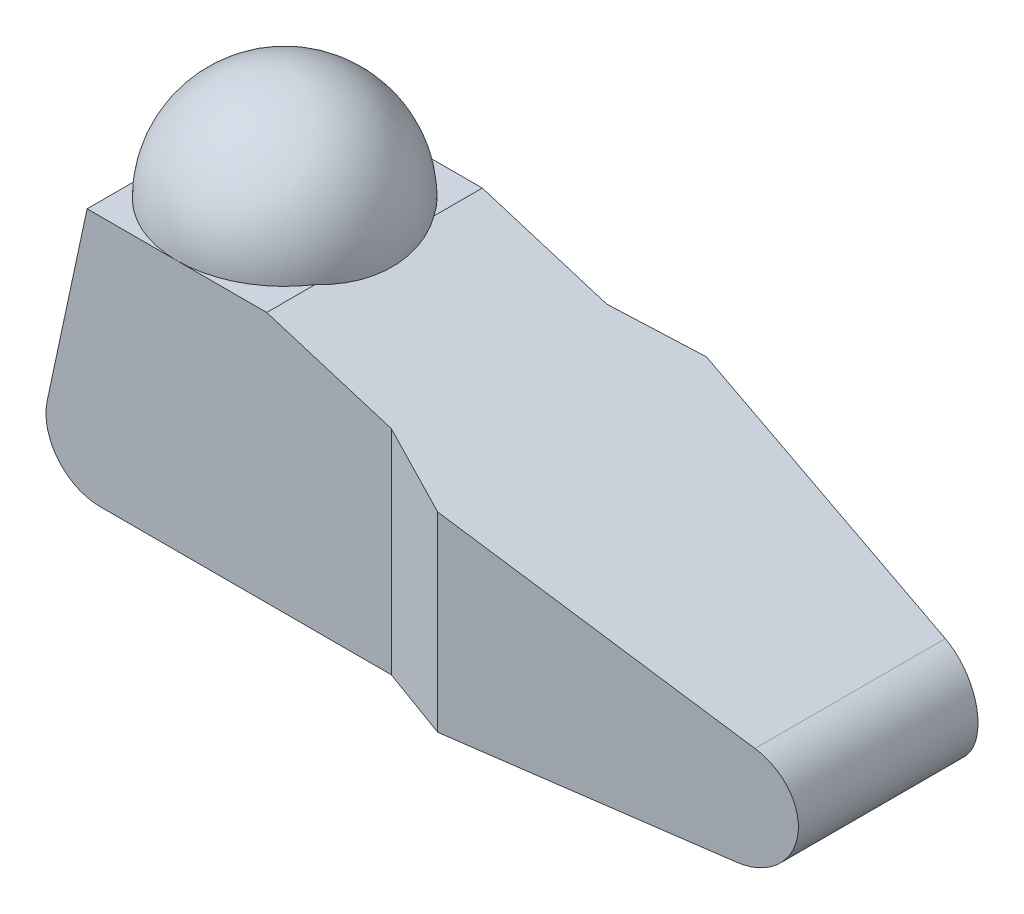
from build123d import *

# Parameters (mm, degrees)
EXTRUDE1_DEPTH     = 47.498
SKETCH3_OUTSIDE_W  = 319.729
SKETCH3_OUTSIDE_H  = 155.08
CUT_EXTRUDE1_DEPTH = 127


with BuildPart() as part:
    # Sketch1 → Extrude1 (new, symmetric)
    with BuildSketch(Plane.XY):
        with BuildLine():
            Line((-27.235393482, 0), (194.31, 0))
            ThreePointArc((194.31, 0), (213.148988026, 16.222451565), (199.902456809, 37.260626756))
            Line((199.902456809, 37.260626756), (31.75, 88.9))
            Line((31.75, 88.9), (-31.75, 88.9))
            Line((-31.75, 88.9), (-45.86252947, 23.04152914))
            ThreePointArc((-45.86252947, 23.04152914), (-42.049932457, 7.073692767), (-27.235393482, 0))
        make_face()
    extrude(amount=EXTRUDE1_DEPTH, both=True)

    # Sketch3 outside → Cut-Extrude1 (cut)
    with BuildSketch(Plane.XZ):
        with Locations((83.5375, 0)):
            Rectangle(SKETCH3_OUTSIDE_W, SKETCH3_OUTSIDE_H)
        Polygon((213.36, 31.75), (101.6, 47.498), (75.779207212, 38.1), (-50.8, 38.1), (-50.8, -38.1), (75.779207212, -38.1), (101.6, -47.498), (213.36, -31.75), align=None, mode=Mode.SUBTRACT)
    extrude(amount=-CUT_EXTRUDE1_DEPTH, mode=Mode.SUBTRACT)

    # Sketch2 → Revolve1 (revolve)
    with BuildSketch(Plane(origin=(0, 88.9, 0), x_dir=(1, 0, 0), z_dir=(0, 1, 0))):
        with BuildLine():
            Line((0, -38.1), (0, 38.1))
            ThreePointArc((0, 38.1), (-38.1, 0), (0, -38.1))
        make_face()
    revolve(axis=Axis((0, 88.9, 38.1), (0, 0, -1)))


solid = part.part
